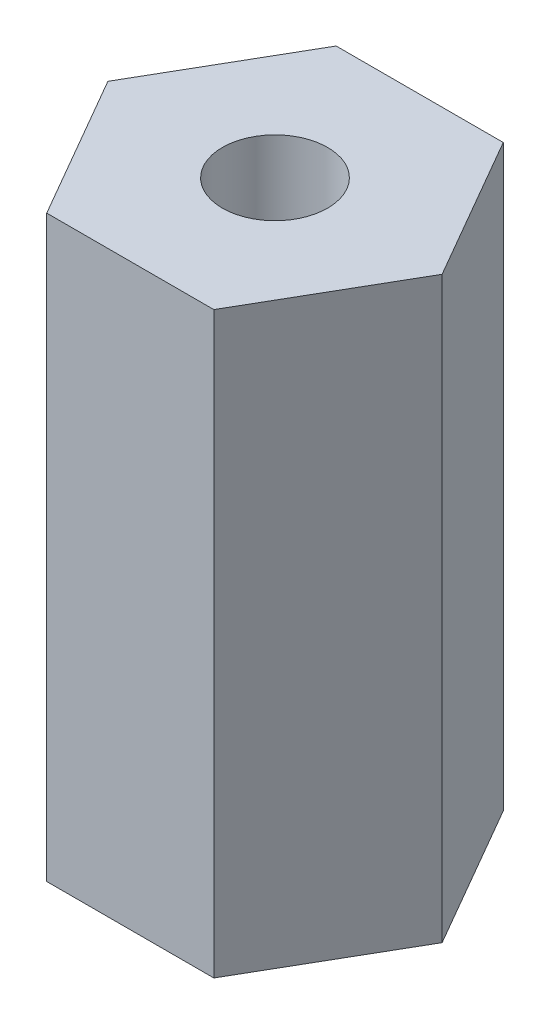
from build123d import *

# Parameters (mm, degrees)
SALIENTE_EXTRUIR1_DEPTH = 11
CROQUIS2_R              = 1
CORTAR_EXTRUIR1_DEPTH   = 12.77479653


with BuildPart() as part:
    # Croquis1 → Saliente-Extruir1 (new body)
    with BuildSketch(Plane(origin=(0, 0, 0), x_dir=(1, 0, 0), z_dir=(0, 1, 0))):
        Polygon((1.58771324, 2.75), (-1.58771324, 2.75), (-3.175426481, 0), (-1.58771324, -2.75), (1.58771324, -2.75), (3.175426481, 0), align=None)
    extrude(amount=SALIENTE_EXTRUIR1_DEPTH)

    # Croquis2 → Cortar-Extruir1 (cut, through all)
    with BuildSketch(Plane(origin=(0, 11, 0), x_dir=(1, 0, 0), z_dir=(0, 1, 0))):
        with Locations(Location((0, 0, 0), (0, 0, 270))):
            Circle(CROQUIS2_R)
    extrude(amount=-CORTAR_EXTRUIR1_DEPTH, mode=Mode.SUBTRACT)


solid = part.part
